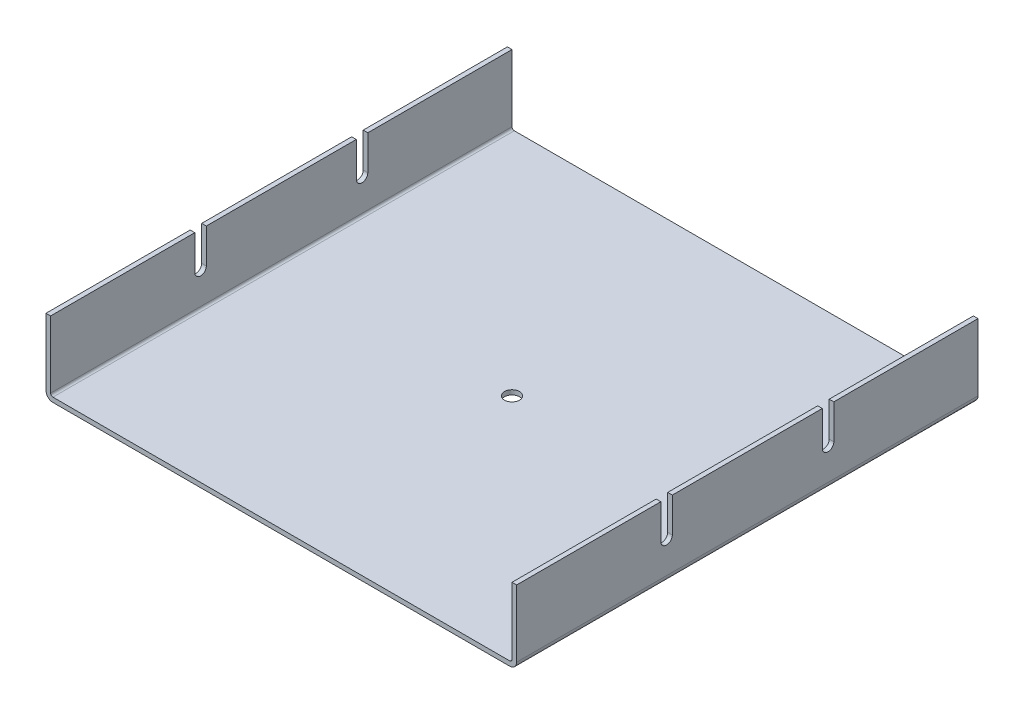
ISO-10303-21;
HEADER;
FILE_DESCRIPTION(('STEP AP214'),'2;1');
FILE_NAME('part.step','',(''),(''),'','','');
FILE_SCHEMA(('AUTOMOTIVE_DESIGN { 1 0 10303 214 1 1 1 1 }'));
ENDSEC;
DATA;
#1=APPLICATION_CONTEXT('core data for automotive mechanical design processes');
#2=APPLICATION_PROTOCOL_DEFINITION('international standard','automotive_design',2000,#1);
#3=PRODUCT_CONTEXT('',#1,'mechanical');
#4=PRODUCT('Part','Part','',(#3));
#5=PRODUCT_RELATED_PRODUCT_CATEGORY('part','',(#4));
#6=PRODUCT_DEFINITION_FORMATION('','',#4);
#7=PRODUCT_DEFINITION_CONTEXT('part definition',#1,'design');
#8=PRODUCT_DEFINITION('design','',#6,#7);
#9=PRODUCT_DEFINITION_SHAPE('','',#8);
#10=(LENGTH_UNIT() NAMED_UNIT(*) SI_UNIT(.MILLI.,.METRE.));
#11=(NAMED_UNIT(*) PLANE_ANGLE_UNIT() SI_UNIT($,.RADIAN.));
#12=(NAMED_UNIT(*) SI_UNIT($,.STERADIAN.) SOLID_ANGLE_UNIT());
#13=UNCERTAINTY_MEASURE_WITH_UNIT(LENGTH_MEASURE(1.E-05),#10,'distance_accuracy_value','');
#14=(GEOMETRIC_REPRESENTATION_CONTEXT(3) GLOBAL_UNCERTAINTY_ASSIGNED_CONTEXT((#13)) GLOBAL_UNIT_ASSIGNED_CONTEXT((#10,
#11,#12)) REPRESENTATION_CONTEXT('',''));
#15=CARTESIAN_POINT('',(0.,0.,0.));
#16=DIRECTION('',(0.,0.,1.));
#17=DIRECTION('',(1.,0.,0.));
#18=AXIS2_PLACEMENT_3D('',#15,#16,#17);
#19=CARTESIAN_POINT('',(100.,30.,100.));
#20=DIRECTION('',(0.,-1.,0.));
#21=DIRECTION('',(0.,0.,-1.));
#22=AXIS2_PLACEMENT_3D('',#19,#20,#21);
#23=PLANE('',#22);
#24=DIRECTION('',(0.,0.,-1.));
#25=VECTOR('',#24,1.);
#26=CARTESIAN_POINT('',(100.,30.,100.));
#27=LINE('',#26,#25);
#28=CARTESIAN_POINT('',(100.,30.,32.5));
#29=VERTEX_POINT('',#28);
#30=CARTESIAN_POINT('',(100.,30.,-32.5));
#31=VERTEX_POINT('',#30);
#32=EDGE_CURVE('E42',#29,#31,#27,.T.);
#33=ORIENTED_EDGE('',*,*,#32,.F.);
#34=DIRECTION('',(-1.,0.,0.));
#35=VECTOR('',#34,1.);
#36=CARTESIAN_POINT('',(102.,30.,32.5));
#37=LINE('',#36,#35);
#38=CARTESIAN_POINT('',(102.,30.,32.5));
#39=VERTEX_POINT('',#38);
#40=EDGE_CURVE('E256',#39,#29,#37,.T.);
#41=ORIENTED_EDGE('',*,*,#40,.F.);
#42=DIRECTION('',(0.,0.,-1.));
#43=VECTOR('',#42,1.);
#44=CARTESIAN_POINT('',(102.,30.,100.));
#45=LINE('',#44,#43);
#46=CARTESIAN_POINT('',(102.,30.,-32.5));
#47=VERTEX_POINT('',#46);
#48=EDGE_CURVE('E387',#39,#47,#45,.T.);
#49=ORIENTED_EDGE('',*,*,#48,.T.);
#50=DIRECTION('',(-1.,0.,0.));
#51=VECTOR('',#50,1.);
#52=CARTESIAN_POINT('',(102.,30.,-32.5));
#53=LINE('',#52,#51);
#54=EDGE_CURVE('E296',#47,#31,#53,.T.);
#55=ORIENTED_EDGE('',*,*,#54,.T.);
#56=EDGE_LOOP('',(#33,#41,#49,#55));
#57=FACE_BOUND('',#56,.T.);
#58=ADVANCED_FACE('F34',(#57),#23,.F.);
#59=CARTESIAN_POINT('',(-102.,30.,100.));
#60=DIRECTION('',(0.,-1.,0.));
#61=DIRECTION('',(0.,0.,-1.));
#62=AXIS2_PLACEMENT_3D('',#59,#60,#61);
#63=PLANE('',#62);
#64=DIRECTION('',(0.,0.,-1.));
#65=VECTOR('',#64,1.);
#66=CARTESIAN_POINT('',(-102.,30.,100.));
#67=LINE('',#66,#65);
#68=CARTESIAN_POINT('',(-102.,30.,32.5));
#69=VERTEX_POINT('',#68);
#70=CARTESIAN_POINT('',(-102.,30.,-32.5));
#71=VERTEX_POINT('',#70);
#72=EDGE_CURVE('E404',#69,#71,#67,.T.);
#73=ORIENTED_EDGE('',*,*,#72,.F.);
#74=CARTESIAN_POINT('',(-100.,30.,32.5));
#75=VERTEX_POINT('',#74);
#76=EDGE_CURVE('E258',#75,#69,#37,.T.);
#77=ORIENTED_EDGE('',*,*,#76,.F.);
#78=DIRECTION('',(0.,0.,-1.));
#79=VECTOR('',#78,1.);
#80=CARTESIAN_POINT('',(-100.,30.,100.));
#81=LINE('',#80,#79);
#82=CARTESIAN_POINT('',(-100.,30.,-32.5));
#83=VERTEX_POINT('',#82);
#84=EDGE_CURVE('E409',#75,#83,#81,.T.);
#85=ORIENTED_EDGE('',*,*,#84,.T.);
#86=EDGE_CURVE('E299',#83,#71,#53,.T.);
#87=ORIENTED_EDGE('',*,*,#86,.T.);
#88=EDGE_LOOP('',(#73,#77,#85,#87));
#89=FACE_BOUND('',#88,.T.);
#90=ADVANCED_FACE('F465',(#89),#63,.F.);
#91=CARTESIAN_POINT('',(100.,30.,-37.5));
#92=VERTEX_POINT('',#91);
#93=CARTESIAN_POINT('',(100.,30.,-100.));
#94=VERTEX_POINT('',#93);
#95=EDGE_CURVE('E43',#92,#94,#27,.T.);
#96=ORIENTED_EDGE('',*,*,#95,.F.);
#97=DIRECTION('',(-1.,0.,0.));
#98=VECTOR('',#97,1.);
#99=CARTESIAN_POINT('',(102.,30.,-37.5));
#100=LINE('',#99,#98);
#101=CARTESIAN_POINT('',(102.,30.,-37.5));
#102=VERTEX_POINT('',#101);
#103=EDGE_CURVE('E292',#102,#92,#100,.T.);
#104=ORIENTED_EDGE('',*,*,#103,.F.);
#105=CARTESIAN_POINT('',(102.,30.,-100.));
#106=VERTEX_POINT('',#105);
#107=EDGE_CURVE('E357',#102,#106,#45,.T.);
#108=ORIENTED_EDGE('',*,*,#107,.T.);
#109=DIRECTION('',(-1.,0.,0.));
#110=VECTOR('',#109,1.);
#111=CARTESIAN_POINT('',(100.,30.,-100.));
#112=LINE('',#111,#110);
#113=EDGE_CURVE('E330',#106,#94,#112,.T.);
#114=ORIENTED_EDGE('',*,*,#113,.T.);
#115=EDGE_LOOP('',(#96,#104,#108,#114));
#116=FACE_BOUND('',#115,.T.);
#117=ADVANCED_FACE('F438',(#116),#23,.F.);
#118=CARTESIAN_POINT('',(-102.,30.,-37.5));
#119=VERTEX_POINT('',#118);
#120=CARTESIAN_POINT('',(-102.,30.,-100.));
#121=VERTEX_POINT('',#120);
#122=EDGE_CURVE('E399',#119,#121,#67,.T.);
#123=ORIENTED_EDGE('',*,*,#122,.F.);
#124=CARTESIAN_POINT('',(-100.,30.,-37.5));
#125=VERTEX_POINT('',#124);
#126=EDGE_CURVE('E295',#125,#119,#100,.T.);
#127=ORIENTED_EDGE('',*,*,#126,.F.);
#128=CARTESIAN_POINT('',(-100.,30.,-100.));
#129=VERTEX_POINT('',#128);
#130=EDGE_CURVE('E403',#125,#129,#81,.T.);
#131=ORIENTED_EDGE('',*,*,#130,.T.);
#132=DIRECTION('',(-1.,0.,0.));
#133=VECTOR('',#132,1.);
#134=CARTESIAN_POINT('',(-102.,30.,-100.));
#135=LINE('',#134,#133);
#136=EDGE_CURVE('E371',#129,#121,#135,.T.);
#137=ORIENTED_EDGE('',*,*,#136,.T.);
#138=EDGE_LOOP('',(#123,#127,#131,#137));
#139=FACE_BOUND('',#138,.T.);
#140=ADVANCED_FACE('F457',(#139),#63,.F.);
#141=CARTESIAN_POINT('',(102.,30.,100.));
#142=VERTEX_POINT('',#141);
#143=CARTESIAN_POINT('',(102.,30.,37.5));
#144=VERTEX_POINT('',#143);
#145=EDGE_CURVE('E384',#142,#144,#45,.T.);
#146=ORIENTED_EDGE('',*,*,#145,.T.);
#147=DIRECTION('',(-1.,0.,0.));
#148=VECTOR('',#147,1.);
#149=CARTESIAN_POINT('',(102.,30.,37.5));
#150=LINE('',#149,#148);
#151=CARTESIAN_POINT('',(100.,30.,37.5));
#152=VERTEX_POINT('',#151);
#153=EDGE_CURVE('E58',#144,#152,#150,.T.);
#154=ORIENTED_EDGE('',*,*,#153,.T.);
#155=CARTESIAN_POINT('',(100.,30.,100.));
#156=VERTEX_POINT('',#155);
#157=EDGE_CURVE('E11',#156,#152,#27,.T.);
#158=ORIENTED_EDGE('',*,*,#157,.F.);
#159=DIRECTION('',(-1.,0.,0.));
#160=VECTOR('',#159,1.);
#161=CARTESIAN_POINT('',(100.,30.,100.));
#162=LINE('',#161,#160);
#163=EDGE_CURVE('E331',#142,#156,#162,.T.);
#164=ORIENTED_EDGE('',*,*,#163,.F.);
#165=EDGE_LOOP('',(#146,#154,#158,#164));
#166=FACE_BOUND('',#165,.T.);
#167=ADVANCED_FACE('F36',(#166),#23,.F.);
#168=CARTESIAN_POINT('',(100.,1.00000000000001,100.));
#169=DIRECTION('',(1.,0.,0.));
#170=DIRECTION('',(0.,0.,-1.));
#171=AXIS2_PLACEMENT_3D('',#168,#169,#170);
#172=PLANE('',#171);
#173=CARTESIAN_POINT('',(100.,15.,35.));
#174=DIRECTION('',(1.,0.,0.));
#175=DIRECTION('',(0.,0.,-1.));
#176=AXIS2_PLACEMENT_3D('',#173,#174,#175);
#177=CIRCLE('',#176,2.5);
#178=CARTESIAN_POINT('',(100.,15.,37.5));
#179=VERTEX_POINT('',#178);
#180=CARTESIAN_POINT('',(100.,15.,32.5));
#181=VERTEX_POINT('',#180);
#182=EDGE_CURVE('E229',#179,#181,#177,.T.);
#183=ORIENTED_EDGE('',*,*,#182,.T.);
#184=DIRECTION('',(0.,1.,0.));
#185=VECTOR('',#184,1.);
#186=CARTESIAN_POINT('',(100.,1.00000000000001,32.5));
#187=LINE('',#186,#185);
#188=EDGE_CURVE('E267',#181,#29,#187,.T.);
#189=ORIENTED_EDGE('',*,*,#188,.T.);
#190=ORIENTED_EDGE('',*,*,#32,.T.);
#191=DIRECTION('',(0.,-1.,0.));
#192=VECTOR('',#191,1.);
#193=CARTESIAN_POINT('',(100.,1.00000000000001,-32.5));
#194=LINE('',#193,#192);
#195=CARTESIAN_POINT('',(100.,15.,-32.5));
#196=VERTEX_POINT('',#195);
#197=EDGE_CURVE('E315',#31,#196,#194,.T.);
#198=ORIENTED_EDGE('',*,*,#197,.T.);
#199=CARTESIAN_POINT('',(100.,15.,-35.));
#200=DIRECTION('',(1.,0.,0.));
#201=DIRECTION('',(0.,0.,-1.));
#202=AXIS2_PLACEMENT_3D('',#199,#200,#201);
#203=CIRCLE('',#202,2.5);
#204=CARTESIAN_POINT('',(100.,15.,-37.5));
#205=VERTEX_POINT('',#204);
#206=EDGE_CURVE('E309',#196,#205,#203,.T.);
#207=ORIENTED_EDGE('',*,*,#206,.T.);
#208=DIRECTION('',(0.,1.,0.));
#209=VECTOR('',#208,1.);
#210=CARTESIAN_POINT('',(100.,1.00000000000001,-37.5));
#211=LINE('',#210,#209);
#212=EDGE_CURVE('E321',#205,#92,#211,.T.);
#213=ORIENTED_EDGE('',*,*,#212,.T.);
#214=ORIENTED_EDGE('',*,*,#95,.T.);
#215=DIRECTION('',(0.,-1.,0.));
#216=VECTOR('',#215,1.);
#217=CARTESIAN_POINT('',(100.,1.00000000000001,-100.));
#218=LINE('',#217,#216);
#219=CARTESIAN_POINT('',(100.,1.00000000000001,-100.));
#220=VERTEX_POINT('',#219);
#221=EDGE_CURVE('E360',#94,#220,#218,.T.);
#222=ORIENTED_EDGE('',*,*,#221,.T.);
#223=DIRECTION('',(0.,0.,-1.));
#224=VECTOR('',#223,1.);
#225=CARTESIAN_POINT('',(100.,1.00000000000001,100.));
#226=LINE('',#225,#224);
#227=CARTESIAN_POINT('',(100.,1.00000000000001,100.));
#228=VERTEX_POINT('',#227);
#229=EDGE_CURVE('E417',#228,#220,#226,.T.);
#230=ORIENTED_EDGE('',*,*,#229,.F.);
#231=DIRECTION('',(0.,-1.,0.));
#232=VECTOR('',#231,1.);
#233=CARTESIAN_POINT('',(100.,1.00000000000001,100.));
#234=LINE('',#233,#232);
#235=EDGE_CURVE('E334',#156,#228,#234,.T.);
#236=ORIENTED_EDGE('',*,*,#235,.F.);
#237=ORIENTED_EDGE('',*,*,#157,.T.);
#238=DIRECTION('',(0.,-1.,0.));
#239=VECTOR('',#238,1.);
#240=CARTESIAN_POINT('',(100.,1.00000000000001,37.5));
#241=LINE('',#240,#239);
#242=EDGE_CURVE('E262',#152,#179,#241,.T.);
#243=ORIENTED_EDGE('',*,*,#242,.T.);
#244=EDGE_LOOP('',(#183,#189,#190,#198,#207,#213,#214,#222,#230,#236,#237,#243));
#245=FACE_BOUND('',#244,.T.);
#246=ADVANCED_FACE('F428',(#245),#172,.F.);
#247=CARTESIAN_POINT('',(99.,1.,100.));
#248=DIRECTION('',(0.,0.,-1.));
#249=DIRECTION('',(-1.,0.,0.));
#250=AXIS2_PLACEMENT_3D('',#247,#248,#249);
#251=CYLINDRICAL_SURFACE('',#250,1.);
#252=CARTESIAN_POINT('',(99.,1.,-100.));
#253=DIRECTION('',(0.,0.,-1.));
#254=DIRECTION('',(1.,0.,0.));
#255=AXIS2_PLACEMENT_3D('',#252,#253,#254);
#256=CIRCLE('',#255,1.);
#257=CARTESIAN_POINT('',(99.,0.,-100.));
#258=VERTEX_POINT('',#257);
#259=EDGE_CURVE('E362',#220,#258,#256,.T.);
#260=ORIENTED_EDGE('',*,*,#259,.T.);
#261=DIRECTION('',(0.,0.,-1.));
#262=VECTOR('',#261,1.);
#263=CARTESIAN_POINT('',(99.,0.,100.));
#264=LINE('',#263,#262);
#265=CARTESIAN_POINT('',(99.,0.,100.));
#266=VERTEX_POINT('',#265);
#267=EDGE_CURVE('E415',#266,#258,#264,.T.);
#268=ORIENTED_EDGE('',*,*,#267,.F.);
#269=CARTESIAN_POINT('',(99.,1.,100.));
#270=DIRECTION('',(0.,0.,-1.));
#271=DIRECTION('',(1.,0.,0.));
#272=AXIS2_PLACEMENT_3D('',#269,#270,#271);
#273=CIRCLE('',#272,1.);
#274=EDGE_CURVE('E337',#228,#266,#273,.T.);
#275=ORIENTED_EDGE('',*,*,#274,.F.);
#276=ORIENTED_EDGE('',*,*,#229,.T.);
#277=EDGE_LOOP('',(#260,#268,#275,#276));
#278=FACE_BOUND('',#277,.T.);
#279=ADVANCED_FACE('F448',(#278),#251,.F.);
#280=CARTESIAN_POINT('',(-99.,0.,100.));
#281=DIRECTION('',(0.,-1.,0.));
#282=DIRECTION('',(0.,0.,-1.));
#283=AXIS2_PLACEMENT_3D('',#280,#281,#282);
#284=PLANE('',#283);
#285=CARTESIAN_POINT('',(0.,0.,0.));
#286=DIRECTION('',(0.,-1.,0.));
#287=DIRECTION('',(0.,0.,-1.));
#288=AXIS2_PLACEMENT_3D('',#285,#286,#287);
#289=CIRCLE('',#288,3.25);
#290=CARTESIAN_POINT('',(0.,0.,-3.25));
#291=VERTEX_POINT('',#290);
#292=EDGE_CURVE('E327',#291,#291,#289,.T.);
#293=ORIENTED_EDGE('',*,*,#292,.T.);
#294=EDGE_LOOP('',(#293));
#295=FACE_BOUND('',#294,.T.);
#296=DIRECTION('',(-1.,0.,0.));
#297=VECTOR('',#296,1.);
#298=CARTESIAN_POINT('',(-99.,0.,-100.));
#299=LINE('',#298,#297);
#300=CARTESIAN_POINT('',(-99.,0.,-100.));
#301=VERTEX_POINT('',#300);
#302=EDGE_CURVE('E364',#258,#301,#299,.T.);
#303=ORIENTED_EDGE('',*,*,#302,.T.);
#304=DIRECTION('',(0.,0.,-1.));
#305=VECTOR('',#304,1.);
#306=CARTESIAN_POINT('',(-99.,0.,100.));
#307=LINE('',#306,#305);
#308=CARTESIAN_POINT('',(-99.,0.,100.));
#309=VERTEX_POINT('',#308);
#310=EDGE_CURVE('E412',#309,#301,#307,.T.);
#311=ORIENTED_EDGE('',*,*,#310,.F.);
#312=DIRECTION('',(-1.,0.,0.));
#313=VECTOR('',#312,1.);
#314=CARTESIAN_POINT('',(-99.,0.,100.));
#315=LINE('',#314,#313);
#316=EDGE_CURVE('E339',#266,#309,#315,.T.);
#317=ORIENTED_EDGE('',*,*,#316,.F.);
#318=ORIENTED_EDGE('',*,*,#267,.T.);
#319=EDGE_LOOP('',(#303,#311,#317,#318));
#320=FACE_BOUND('',#319,.T.);
#321=ADVANCED_FACE('F734',(#295,#320),#284,.F.);
#322=CARTESIAN_POINT('',(-99.,1.,100.));
#323=DIRECTION('',(0.,0.,-1.));
#324=DIRECTION('',(-1.,0.,0.));
#325=AXIS2_PLACEMENT_3D('',#322,#323,#324);
#326=CYLINDRICAL_SURFACE('',#325,1.);
#327=CARTESIAN_POINT('',(-99.,1.,-100.));
#328=DIRECTION('',(0.,0.,-1.));
#329=DIRECTION('',(-1.,0.,0.));
#330=AXIS2_PLACEMENT_3D('',#327,#328,#329);
#331=CIRCLE('',#330,1.);
#332=CARTESIAN_POINT('',(-100.,1.00000000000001,-100.));
#333=VERTEX_POINT('',#332);
#334=EDGE_CURVE('E366',#301,#333,#331,.T.);
#335=ORIENTED_EDGE('',*,*,#334,.T.);
#336=DIRECTION('',(0.,0.,-1.));
#337=VECTOR('',#336,1.);
#338=CARTESIAN_POINT('',(-100.,1.00000000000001,100.));
#339=LINE('',#338,#337);
#340=CARTESIAN_POINT('',(-100.,1.00000000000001,100.));
#341=VERTEX_POINT('',#340);
#342=EDGE_CURVE('E408',#341,#333,#339,.T.);
#343=ORIENTED_EDGE('',*,*,#342,.F.);
#344=CARTESIAN_POINT('',(-99.,1.,100.));
#345=DIRECTION('',(0.,0.,-1.));
#346=DIRECTION('',(-1.,0.,0.));
#347=AXIS2_PLACEMENT_3D('',#344,#345,#346);
#348=CIRCLE('',#347,1.);
#349=EDGE_CURVE('E341',#309,#341,#348,.T.);
#350=ORIENTED_EDGE('',*,*,#349,.F.);
#351=ORIENTED_EDGE('',*,*,#310,.T.);
#352=EDGE_LOOP('',(#335,#343,#350,#351));
#353=FACE_BOUND('',#352,.T.);
#354=ADVANCED_FACE('F487',(#353),#326,.F.);
#355=CARTESIAN_POINT('',(-100.,1.00000000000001,100.));
#356=DIRECTION('',(-1.,0.,0.));
#357=DIRECTION('',(0.,0.,1.));
#358=AXIS2_PLACEMENT_3D('',#355,#356,#357);
#359=PLANE('',#358);
#360=ORIENTED_EDGE('',*,*,#84,.F.);
#361=DIRECTION('',(0.,-1.,0.));
#362=VECTOR('',#361,1.);
#363=CARTESIAN_POINT('',(-100.,1.00000000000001,32.5));
#364=LINE('',#363,#362);
#365=CARTESIAN_POINT('',(-100.,15.,32.5));
#366=VERTEX_POINT('',#365);
#367=EDGE_CURVE('E264',#75,#366,#364,.T.);
#368=ORIENTED_EDGE('',*,*,#367,.T.);
#369=CARTESIAN_POINT('',(-100.,15.,35.));
#370=DIRECTION('',(-1.,0.,0.));
#371=DIRECTION('',(0.,0.,1.));
#372=AXIS2_PLACEMENT_3D('',#369,#370,#371);
#373=CIRCLE('',#372,2.5);
#374=CARTESIAN_POINT('',(-100.,15.,37.5));
#375=VERTEX_POINT('',#374);
#376=EDGE_CURVE('E270',#366,#375,#373,.T.);
#377=ORIENTED_EDGE('',*,*,#376,.T.);
#378=DIRECTION('',(0.,1.,0.));
#379=VECTOR('',#378,1.);
#380=CARTESIAN_POINT('',(-100.,1.00000000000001,37.5));
#381=LINE('',#380,#379);
#382=CARTESIAN_POINT('',(-100.,30.,37.5));
#383=VERTEX_POINT('',#382);
#384=EDGE_CURVE('E254',#375,#383,#381,.T.);
#385=ORIENTED_EDGE('',*,*,#384,.T.);
#386=CARTESIAN_POINT('',(-100.,30.,100.));
#387=VERTEX_POINT('',#386);
#388=EDGE_CURVE('E405',#387,#383,#81,.T.);
#389=ORIENTED_EDGE('',*,*,#388,.F.);
#390=DIRECTION('',(0.,1.,0.));
#391=VECTOR('',#390,1.);
#392=CARTESIAN_POINT('',(-100.,1.00000000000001,100.));
#393=LINE('',#392,#391);
#394=EDGE_CURVE('E343',#341,#387,#393,.T.);
#395=ORIENTED_EDGE('',*,*,#394,.F.);
#396=ORIENTED_EDGE('',*,*,#342,.T.);
#397=DIRECTION('',(0.,1.,0.));
#398=VECTOR('',#397,1.);
#399=CARTESIAN_POINT('',(-100.,1.00000000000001,-100.));
#400=LINE('',#399,#398);
#401=EDGE_CURVE('E368',#333,#129,#400,.T.);
#402=ORIENTED_EDGE('',*,*,#401,.T.);
#403=ORIENTED_EDGE('',*,*,#130,.F.);
#404=DIRECTION('',(0.,-1.,0.));
#405=VECTOR('',#404,1.);
#406=CARTESIAN_POINT('',(-100.,1.00000000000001,-37.5));
#407=LINE('',#406,#405);
#408=CARTESIAN_POINT('',(-100.,15.,-37.5));
#409=VERTEX_POINT('',#408);
#410=EDGE_CURVE('E318',#125,#409,#407,.T.);
#411=ORIENTED_EDGE('',*,*,#410,.T.);
#412=CARTESIAN_POINT('',(-100.,15.,-35.));
#413=DIRECTION('',(-1.,0.,0.));
#414=DIRECTION('',(0.,0.,1.));
#415=AXIS2_PLACEMENT_3D('',#412,#413,#414);
#416=CIRCLE('',#415,2.5);
#417=CARTESIAN_POINT('',(-100.,15.,-32.5));
#418=VERTEX_POINT('',#417);
#419=EDGE_CURVE('E294',#409,#418,#416,.T.);
#420=ORIENTED_EDGE('',*,*,#419,.T.);
#421=DIRECTION('',(0.,1.,0.));
#422=VECTOR('',#421,1.);
#423=CARTESIAN_POINT('',(-100.,1.00000000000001,-32.5));
#424=LINE('',#423,#422);
#425=EDGE_CURVE('E312',#418,#83,#424,.T.);
#426=ORIENTED_EDGE('',*,*,#425,.T.);
#427=EDGE_LOOP('',(#360,#368,#377,#385,#389,#395,#396,#402,#403,#411,#420,#426));
#428=FACE_BOUND('',#427,.T.);
#429=ADVANCED_FACE('F479',(#428),#359,.F.);
#430=ORIENTED_EDGE('',*,*,#388,.T.);
#431=CARTESIAN_POINT('',(-102.,30.,37.5));
#432=VERTEX_POINT('',#431);
#433=EDGE_CURVE('E231',#383,#432,#150,.T.);
#434=ORIENTED_EDGE('',*,*,#433,.T.);
#435=CARTESIAN_POINT('',(-102.,30.,100.));
#436=VERTEX_POINT('',#435);
#437=EDGE_CURVE('E400',#436,#432,#67,.T.);
#438=ORIENTED_EDGE('',*,*,#437,.F.);
#439=DIRECTION('',(-1.,0.,0.));
#440=VECTOR('',#439,1.);
#441=CARTESIAN_POINT('',(-102.,30.,100.));
#442=LINE('',#441,#440);
#443=EDGE_CURVE('E345',#387,#436,#442,.T.);
#444=ORIENTED_EDGE('',*,*,#443,.F.);
#445=EDGE_LOOP('',(#430,#434,#438,#444));
#446=FACE_BOUND('',#445,.T.);
#447=ADVANCED_FACE('F464',(#446),#63,.F.);
#448=CARTESIAN_POINT('',(-102.,1.00000000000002,100.));
#449=DIRECTION('',(1.,0.,0.));
#450=DIRECTION('',(0.,0.,-1.));
#451=AXIS2_PLACEMENT_3D('',#448,#449,#450);
#452=PLANE('',#451);
#453=CARTESIAN_POINT('',(-102.,15.,35.));
#454=DIRECTION('',(-1.,0.,0.));
#455=DIRECTION('',(0.,0.,-1.));
#456=AXIS2_PLACEMENT_3D('',#453,#454,#455);
#457=CIRCLE('',#456,2.5);
#458=CARTESIAN_POINT('',(-102.,15.,32.5));
#459=VERTEX_POINT('',#458);
#460=CARTESIAN_POINT('',(-102.,15.,37.5));
#461=VERTEX_POINT('',#460);
#462=EDGE_CURVE('E50',#459,#461,#457,.T.);
#463=ORIENTED_EDGE('',*,*,#462,.F.);
#464=DIRECTION('',(0.,-1.,0.));
#465=VECTOR('',#464,1.);
#466=CARTESIAN_POINT('',(-102.,30.,32.5));
#467=LINE('',#466,#465);
#468=EDGE_CURVE('E243',#69,#459,#467,.T.);
#469=ORIENTED_EDGE('',*,*,#468,.F.);
#470=ORIENTED_EDGE('',*,*,#72,.T.);
#471=DIRECTION('',(0.,1.,0.));
#472=VECTOR('',#471,1.);
#473=CARTESIAN_POINT('',(-102.,30.,-32.5));
#474=LINE('',#473,#472);
#475=CARTESIAN_POINT('',(-102.,15.,-32.5));
#476=VERTEX_POINT('',#475);
#477=EDGE_CURVE('E279',#476,#71,#474,.T.);
#478=ORIENTED_EDGE('',*,*,#477,.F.);
#479=CARTESIAN_POINT('',(-102.,15.,-35.));
#480=DIRECTION('',(-1.,0.,0.));
#481=DIRECTION('',(0.,0.,1.));
#482=AXIS2_PLACEMENT_3D('',#479,#480,#481);
#483=CIRCLE('',#482,2.5);
#484=CARTESIAN_POINT('',(-102.,15.,-37.5));
#485=VERTEX_POINT('',#484);
#486=EDGE_CURVE('E287',#485,#476,#483,.T.);
#487=ORIENTED_EDGE('',*,*,#486,.F.);
#488=DIRECTION('',(0.,-1.,0.));
#489=VECTOR('',#488,1.);
#490=CARTESIAN_POINT('',(-102.,30.,-37.5));
#491=LINE('',#490,#489);
#492=EDGE_CURVE('E274',#119,#485,#491,.T.);
#493=ORIENTED_EDGE('',*,*,#492,.F.);
#494=ORIENTED_EDGE('',*,*,#122,.T.);
#495=DIRECTION('',(0.,-1.,0.));
#496=VECTOR('',#495,1.);
#497=CARTESIAN_POINT('',(-102.,1.00000000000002,-100.));
#498=LINE('',#497,#496);
#499=CARTESIAN_POINT('',(-102.,1.00000000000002,-100.));
#500=VERTEX_POINT('',#499);
#501=EDGE_CURVE('E374',#121,#500,#498,.T.);
#502=ORIENTED_EDGE('',*,*,#501,.T.);
#503=DIRECTION('',(0.,0.,-1.));
#504=VECTOR('',#503,1.);
#505=CARTESIAN_POINT('',(-102.,1.00000000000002,100.));
#506=LINE('',#505,#504);
#507=CARTESIAN_POINT('',(-102.,1.00000000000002,100.));
#508=VERTEX_POINT('',#507);
#509=EDGE_CURVE('E396',#508,#500,#506,.T.);
#510=ORIENTED_EDGE('',*,*,#509,.F.);
#511=DIRECTION('',(0.,-1.,0.));
#512=VECTOR('',#511,1.);
#513=CARTESIAN_POINT('',(-102.,1.00000000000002,100.));
#514=LINE('',#513,#512);
#515=EDGE_CURVE('E347',#436,#508,#514,.T.);
#516=ORIENTED_EDGE('',*,*,#515,.F.);
#517=ORIENTED_EDGE('',*,*,#437,.T.);
#518=DIRECTION('',(0.,1.,0.));
#519=VECTOR('',#518,1.);
#520=CARTESIAN_POINT('',(-102.,30.,37.5));
#521=LINE('',#520,#519);
#522=EDGE_CURVE('E246',#461,#432,#521,.T.);
#523=ORIENTED_EDGE('',*,*,#522,.F.);
#524=EDGE_LOOP('',(#463,#469,#470,#478,#487,#493,#494,#502,#510,#516,#517,#523));
#525=FACE_BOUND('',#524,.T.);
#526=ADVANCED_FACE('F478',(#525),#452,.F.);
#527=CARTESIAN_POINT('',(-99.,1.,100.));
#528=DIRECTION('',(0.,0.,-1.));
#529=DIRECTION('',(-1.,0.,0.));
#530=AXIS2_PLACEMENT_3D('',#527,#528,#529);
#531=CYLINDRICAL_SURFACE('',#530,3.);
#532=CARTESIAN_POINT('',(-99.,1.,-100.));
#533=DIRECTION('',(0.,0.,1.));
#534=DIRECTION('',(-1.,0.,0.));
#535=AXIS2_PLACEMENT_3D('',#532,#533,#534);
#536=CIRCLE('',#535,3.);
#537=CARTESIAN_POINT('',(-99.,-2.,-100.));
#538=VERTEX_POINT('',#537);
#539=EDGE_CURVE('E376',#500,#538,#536,.T.);
#540=ORIENTED_EDGE('',*,*,#539,.T.);
#541=DIRECTION('',(0.,0.,-1.));
#542=VECTOR('',#541,1.);
#543=CARTESIAN_POINT('',(-99.,-2.,100.));
#544=LINE('',#543,#542);
#545=CARTESIAN_POINT('',(-99.,-2.,100.));
#546=VERTEX_POINT('',#545);
#547=EDGE_CURVE('E393',#546,#538,#544,.T.);
#548=ORIENTED_EDGE('',*,*,#547,.F.);
#549=CARTESIAN_POINT('',(-99.,1.,100.));
#550=DIRECTION('',(0.,0.,1.));
#551=DIRECTION('',(-1.,0.,0.));
#552=AXIS2_PLACEMENT_3D('',#549,#550,#551);
#553=CIRCLE('',#552,3.);
#554=EDGE_CURVE('E349',#508,#546,#553,.T.);
#555=ORIENTED_EDGE('',*,*,#554,.F.);
#556=ORIENTED_EDGE('',*,*,#509,.T.);
#557=EDGE_LOOP('',(#540,#548,#555,#556));
#558=FACE_BOUND('',#557,.T.);
#559=ADVANCED_FACE('F485',(#558),#531,.T.);
#560=CARTESIAN_POINT('',(-99.,-2.,100.));
#561=DIRECTION('',(0.,1.,0.));
#562=DIRECTION('',(0.,0.,1.));
#563=AXIS2_PLACEMENT_3D('',#560,#561,#562);
#564=PLANE('',#563);
#565=CARTESIAN_POINT('',(0.,-2.,0.));
#566=DIRECTION('',(0.,-1.,0.));
#567=DIRECTION('',(0.,0.,-1.));
#568=AXIS2_PLACEMENT_3D('',#565,#566,#567);
#569=CIRCLE('',#568,3.25);
#570=CARTESIAN_POINT('',(0.,-2.,-3.25));
#571=VERTEX_POINT('',#570);
#572=EDGE_CURVE('E324',#571,#571,#569,.T.);
#573=ORIENTED_EDGE('',*,*,#572,.F.);
#574=EDGE_LOOP('',(#573));
#575=FACE_BOUND('',#574,.T.);
#576=DIRECTION('',(1.,0.,0.));
#577=VECTOR('',#576,1.);
#578=CARTESIAN_POINT('',(-99.,-2.,-100.));
#579=LINE('',#578,#577);
#580=CARTESIAN_POINT('',(99.,-2.,-100.));
#581=VERTEX_POINT('',#580);
#582=EDGE_CURVE('E378',#538,#581,#579,.T.);
#583=ORIENTED_EDGE('',*,*,#582,.T.);
#584=DIRECTION('',(0.,0.,-1.));
#585=VECTOR('',#584,1.);
#586=CARTESIAN_POINT('',(99.,-2.,100.));
#587=LINE('',#586,#585);
#588=CARTESIAN_POINT('',(99.,-2.,100.));
#589=VERTEX_POINT('',#588);
#590=EDGE_CURVE('E390',#589,#581,#587,.T.);
#591=ORIENTED_EDGE('',*,*,#590,.F.);
#592=DIRECTION('',(1.,0.,0.));
#593=VECTOR('',#592,1.);
#594=CARTESIAN_POINT('',(-99.,-2.,100.));
#595=LINE('',#594,#593);
#596=EDGE_CURVE('E351',#546,#589,#595,.T.);
#597=ORIENTED_EDGE('',*,*,#596,.F.);
#598=ORIENTED_EDGE('',*,*,#547,.T.);
#599=EDGE_LOOP('',(#583,#591,#597,#598));
#600=FACE_BOUND('',#599,.T.);
#601=ADVANCED_FACE('F560',(#575,#600),#564,.F.);
#602=CARTESIAN_POINT('',(99.,1.,100.));
#603=DIRECTION('',(0.,0.,-1.));
#604=DIRECTION('',(-1.,0.,0.));
#605=AXIS2_PLACEMENT_3D('',#602,#603,#604);
#606=CYLINDRICAL_SURFACE('',#605,3.);
#607=CARTESIAN_POINT('',(99.,1.,-100.));
#608=DIRECTION('',(0.,0.,1.));
#609=DIRECTION('',(-1.,0.,0.));
#610=AXIS2_PLACEMENT_3D('',#607,#608,#609);
#611=CIRCLE('',#610,3.);
#612=CARTESIAN_POINT('',(102.,1.00000000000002,-100.));
#613=VERTEX_POINT('',#612);
#614=EDGE_CURVE('E380',#581,#613,#611,.T.);
#615=ORIENTED_EDGE('',*,*,#614,.T.);
#616=DIRECTION('',(0.,0.,-1.));
#617=VECTOR('',#616,1.);
#618=CARTESIAN_POINT('',(102.,1.00000000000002,100.));
#619=LINE('',#618,#617);
#620=CARTESIAN_POINT('',(102.,1.00000000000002,100.));
#621=VERTEX_POINT('',#620);
#622=EDGE_CURVE('E386',#621,#613,#619,.T.);
#623=ORIENTED_EDGE('',*,*,#622,.F.);
#624=CARTESIAN_POINT('',(99.,1.,100.));
#625=DIRECTION('',(0.,0.,1.));
#626=DIRECTION('',(-1.,0.,0.));
#627=AXIS2_PLACEMENT_3D('',#624,#625,#626);
#628=CIRCLE('',#627,3.);
#629=EDGE_CURVE('E353',#589,#621,#628,.T.);
#630=ORIENTED_EDGE('',*,*,#629,.F.);
#631=ORIENTED_EDGE('',*,*,#590,.T.);
#632=EDGE_LOOP('',(#615,#623,#630,#631));
#633=FACE_BOUND('',#632,.T.);
#634=ADVANCED_FACE('F557',(#633),#606,.T.);
#635=CARTESIAN_POINT('',(102.,1.00000000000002,100.));
#636=DIRECTION('',(-1.,0.,0.));
#637=DIRECTION('',(0.,0.,1.));
#638=AXIS2_PLACEMENT_3D('',#635,#636,#637);
#639=PLANE('',#638);
#640=ORIENTED_EDGE('',*,*,#48,.F.);
#641=DIRECTION('',(0.,-1.,0.));
#642=VECTOR('',#641,1.);
#643=CARTESIAN_POINT('',(102.,30.,32.5));
#644=LINE('',#643,#642);
#645=CARTESIAN_POINT('',(102.,15.,32.5));
#646=VERTEX_POINT('',#645);
#647=EDGE_CURVE('E239',#39,#646,#644,.T.);
#648=ORIENTED_EDGE('',*,*,#647,.T.);
#649=CARTESIAN_POINT('',(102.,15.,35.));
#650=DIRECTION('',(-1.,0.,0.));
#651=DIRECTION('',(0.,0.,-1.));
#652=AXIS2_PLACEMENT_3D('',#649,#650,#651);
#653=CIRCLE('',#652,2.5);
#654=CARTESIAN_POINT('',(102.,15.,37.5));
#655=VERTEX_POINT('',#654);
#656=EDGE_CURVE('E226',#646,#655,#653,.T.);
#657=ORIENTED_EDGE('',*,*,#656,.T.);
#658=DIRECTION('',(0.,1.,0.));
#659=VECTOR('',#658,1.);
#660=CARTESIAN_POINT('',(102.,30.,37.5));
#661=LINE('',#660,#659);
#662=EDGE_CURVE('E234',#655,#144,#661,.T.);
#663=ORIENTED_EDGE('',*,*,#662,.T.);
#664=ORIENTED_EDGE('',*,*,#145,.F.);
#665=DIRECTION('',(0.,1.,0.));
#666=VECTOR('',#665,1.);
#667=CARTESIAN_POINT('',(102.,1.00000000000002,100.));
#668=LINE('',#667,#666);
#669=EDGE_CURVE('E355',#621,#142,#668,.T.);
#670=ORIENTED_EDGE('',*,*,#669,.F.);
#671=ORIENTED_EDGE('',*,*,#622,.T.);
#672=DIRECTION('',(0.,1.,0.));
#673=VECTOR('',#672,1.);
#674=CARTESIAN_POINT('',(102.,1.00000000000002,-100.));
#675=LINE('',#674,#673);
#676=EDGE_CURVE('E335',#613,#106,#675,.T.);
#677=ORIENTED_EDGE('',*,*,#676,.T.);
#678=ORIENTED_EDGE('',*,*,#107,.F.);
#679=DIRECTION('',(0.,-1.,0.));
#680=VECTOR('',#679,1.);
#681=CARTESIAN_POINT('',(102.,30.,-37.5));
#682=LINE('',#681,#680);
#683=CARTESIAN_POINT('',(102.,15.,-37.5));
#684=VERTEX_POINT('',#683);
#685=EDGE_CURVE('E275',#102,#684,#682,.T.);
#686=ORIENTED_EDGE('',*,*,#685,.T.);
#687=CARTESIAN_POINT('',(102.,15.,-35.));
#688=DIRECTION('',(-1.,0.,0.));
#689=DIRECTION('',(0.,0.,1.));
#690=AXIS2_PLACEMENT_3D('',#687,#688,#689);
#691=CIRCLE('',#690,2.5);
#692=CARTESIAN_POINT('',(102.,15.,-32.5));
#693=VERTEX_POINT('',#692);
#694=EDGE_CURVE('E278',#684,#693,#691,.T.);
#695=ORIENTED_EDGE('',*,*,#694,.T.);
#696=DIRECTION('',(0.,1.,0.));
#697=VECTOR('',#696,1.);
#698=CARTESIAN_POINT('',(102.,30.,-32.5));
#699=LINE('',#698,#697);
#700=EDGE_CURVE('E282',#693,#47,#699,.T.);
#701=ORIENTED_EDGE('',*,*,#700,.T.);
#702=EDGE_LOOP('',(#640,#648,#657,#663,#664,#670,#671,#677,#678,#686,#695,#701));
#703=FACE_BOUND('',#702,.T.);
#704=ADVANCED_FACE('F242',(#703),#639,.F.);
#705=CARTESIAN_POINT('',(99.,1.,100.));
#706=DIRECTION('',(0.,0.,-1.));
#707=DIRECTION('',(-1.,0.,0.));
#708=AXIS2_PLACEMENT_3D('',#705,#706,#707);
#709=PLANE('',#708);
#710=ORIENTED_EDGE('',*,*,#163,.T.);
#711=ORIENTED_EDGE('',*,*,#235,.T.);
#712=ORIENTED_EDGE('',*,*,#274,.T.);
#713=ORIENTED_EDGE('',*,*,#316,.T.);
#714=ORIENTED_EDGE('',*,*,#349,.T.);
#715=ORIENTED_EDGE('',*,*,#394,.T.);
#716=ORIENTED_EDGE('',*,*,#443,.T.);
#717=ORIENTED_EDGE('',*,*,#515,.T.);
#718=ORIENTED_EDGE('',*,*,#554,.T.);
#719=ORIENTED_EDGE('',*,*,#596,.T.);
#720=ORIENTED_EDGE('',*,*,#629,.T.);
#721=ORIENTED_EDGE('',*,*,#669,.T.);
#722=EDGE_LOOP('',(#710,#711,#712,#713,#714,#715,#716,#717,#718,#719,#720,#721));
#723=FACE_BOUND('',#722,.T.);
#724=ADVANCED_FACE('F451',(#723),#709,.F.);
#725=CARTESIAN_POINT('',(99.,1.,-100.));
#726=DIRECTION('',(0.,0.,-1.));
#727=DIRECTION('',(-1.,0.,0.));
#728=AXIS2_PLACEMENT_3D('',#725,#726,#727);
#729=PLANE('',#728);
#730=ORIENTED_EDGE('',*,*,#113,.F.);
#731=ORIENTED_EDGE('',*,*,#676,.F.);
#732=ORIENTED_EDGE('',*,*,#614,.F.);
#733=ORIENTED_EDGE('',*,*,#582,.F.);
#734=ORIENTED_EDGE('',*,*,#539,.F.);
#735=ORIENTED_EDGE('',*,*,#501,.F.);
#736=ORIENTED_EDGE('',*,*,#136,.F.);
#737=ORIENTED_EDGE('',*,*,#401,.F.);
#738=ORIENTED_EDGE('',*,*,#334,.F.);
#739=ORIENTED_EDGE('',*,*,#302,.F.);
#740=ORIENTED_EDGE('',*,*,#259,.F.);
#741=ORIENTED_EDGE('',*,*,#221,.F.);
#742=EDGE_LOOP('',(#730,#731,#732,#733,#734,#735,#736,#737,#738,#739,#740,#741));
#743=FACE_BOUND('',#742,.T.);
#744=ADVANCED_FACE('F445',(#743),#729,.T.);
#745=CARTESIAN_POINT('',(0.,30.,0.));
#746=DIRECTION('',(0.,-1.,0.));
#747=DIRECTION('',(0.,0.,-1.));
#748=AXIS2_PLACEMENT_3D('',#745,#746,#747);
#749=CYLINDRICAL_SURFACE('',#748,3.25);
#750=ORIENTED_EDGE('',*,*,#572,.T.);
#751=EDGE_LOOP('',(#750));
#752=FACE_BOUND('',#751,.T.);
#753=ORIENTED_EDGE('',*,*,#292,.F.);
#754=EDGE_LOOP('',(#753));
#755=FACE_BOUND('',#754,.T.);
#756=ADVANCED_FACE('F547',(#752,#755),#749,.F.);
#757=CARTESIAN_POINT('',(102.,15.,-35.));
#758=DIRECTION('',(-1.,0.,0.));
#759=DIRECTION('',(0.,0.,1.));
#760=AXIS2_PLACEMENT_3D('',#757,#758,#759);
#761=CYLINDRICAL_SURFACE('',#760,2.5);
#762=DIRECTION('',(-1.,0.,0.));
#763=VECTOR('',#762,1.);
#764=CARTESIAN_POINT('',(102.,15.,-32.5));
#765=LINE('',#764,#763);
#766=EDGE_CURVE('E300',#693,#196,#765,.T.);
#767=ORIENTED_EDGE('',*,*,#766,.F.);
#768=ORIENTED_EDGE('',*,*,#694,.F.);
#769=DIRECTION('',(-1.,0.,0.));
#770=VECTOR('',#769,1.);
#771=CARTESIAN_POINT('',(102.,15.,-37.5));
#772=LINE('',#771,#770);
#773=EDGE_CURVE('E304',#684,#205,#772,.T.);
#774=ORIENTED_EDGE('',*,*,#773,.T.);
#775=ORIENTED_EDGE('',*,*,#206,.F.);
#776=EDGE_LOOP('',(#767,#768,#774,#775));
#777=FACE_BOUND('',#776,.T.);
#778=ADVANCED_FACE('F546',(#777),#761,.F.);
#779=CARTESIAN_POINT('',(102.,30.,-32.5));
#780=DIRECTION('',(0.,0.,1.));
#781=DIRECTION('',(1.,0.,0.));
#782=AXIS2_PLACEMENT_3D('',#779,#780,#781);
#783=PLANE('',#782);
#784=ORIENTED_EDGE('',*,*,#54,.F.);
#785=ORIENTED_EDGE('',*,*,#700,.F.);
#786=ORIENTED_EDGE('',*,*,#766,.T.);
#787=ORIENTED_EDGE('',*,*,#197,.F.);
#788=EDGE_LOOP('',(#784,#785,#786,#787));
#789=FACE_BOUND('',#788,.T.);
#790=ADVANCED_FACE('F433',(#789),#783,.F.);
#791=CARTESIAN_POINT('',(102.,30.,-37.5));
#792=DIRECTION('',(0.,0.,-1.));
#793=DIRECTION('',(-1.,0.,0.));
#794=AXIS2_PLACEMENT_3D('',#791,#792,#793);
#795=PLANE('',#794);
#796=ORIENTED_EDGE('',*,*,#773,.F.);
#797=ORIENTED_EDGE('',*,*,#685,.F.);
#798=ORIENTED_EDGE('',*,*,#103,.T.);
#799=ORIENTED_EDGE('',*,*,#212,.F.);
#800=EDGE_LOOP('',(#796,#797,#798,#799));
#801=FACE_BOUND('',#800,.T.);
#802=ADVANCED_FACE('F536',(#801),#795,.F.);
#803=ORIENTED_EDGE('',*,*,#126,.T.);
#804=ORIENTED_EDGE('',*,*,#492,.T.);
#805=EDGE_CURVE('E285',#409,#485,#772,.T.);
#806=ORIENTED_EDGE('',*,*,#805,.F.);
#807=ORIENTED_EDGE('',*,*,#410,.F.);
#808=EDGE_LOOP('',(#803,#804,#806,#807));
#809=FACE_BOUND('',#808,.T.);
#810=ADVANCED_FACE('F534',(#809),#795,.F.);
#811=EDGE_CURVE('E303',#418,#476,#765,.T.);
#812=ORIENTED_EDGE('',*,*,#811,.T.);
#813=ORIENTED_EDGE('',*,*,#477,.T.);
#814=ORIENTED_EDGE('',*,*,#86,.F.);
#815=ORIENTED_EDGE('',*,*,#425,.F.);
#816=EDGE_LOOP('',(#812,#813,#814,#815));
#817=FACE_BOUND('',#816,.T.);
#818=ADVANCED_FACE('F526',(#817),#783,.F.);
#819=ORIENTED_EDGE('',*,*,#805,.T.);
#820=ORIENTED_EDGE('',*,*,#486,.T.);
#821=ORIENTED_EDGE('',*,*,#811,.F.);
#822=ORIENTED_EDGE('',*,*,#419,.F.);
#823=EDGE_LOOP('',(#819,#820,#821,#822));
#824=FACE_BOUND('',#823,.T.);
#825=ADVANCED_FACE('F531',(#824),#761,.F.);
#826=CARTESIAN_POINT('',(102.,30.,32.5));
#827=DIRECTION('',(0.,0.,-1.));
#828=DIRECTION('',(-1.,0.,0.));
#829=AXIS2_PLACEMENT_3D('',#826,#827,#828);
#830=PLANE('',#829);
#831=DIRECTION('',(-1.,0.,0.));
#832=VECTOR('',#831,1.);
#833=CARTESIAN_POINT('',(102.,15.,32.5));
#834=LINE('',#833,#832);
#835=EDGE_CURVE('E252',#646,#181,#834,.T.);
#836=ORIENTED_EDGE('',*,*,#835,.F.);
#837=ORIENTED_EDGE('',*,*,#647,.F.);
#838=ORIENTED_EDGE('',*,*,#40,.T.);
#839=ORIENTED_EDGE('',*,*,#188,.F.);
#840=EDGE_LOOP('',(#836,#837,#838,#839));
#841=FACE_BOUND('',#840,.T.);
#842=ADVANCED_FACE('F631',(#841),#830,.F.);
#843=CARTESIAN_POINT('',(102.,30.,37.5));
#844=DIRECTION('',(0.,0.,1.));
#845=DIRECTION('',(1.,0.,0.));
#846=AXIS2_PLACEMENT_3D('',#843,#844,#845);
#847=PLANE('',#846);
#848=ORIENTED_EDGE('',*,*,#153,.F.);
#849=ORIENTED_EDGE('',*,*,#662,.F.);
#850=DIRECTION('',(-1.,0.,0.));
#851=VECTOR('',#850,1.);
#852=CARTESIAN_POINT('',(102.,15.,37.5));
#853=LINE('',#852,#851);
#854=EDGE_CURVE('E222',#655,#179,#853,.T.);
#855=ORIENTED_EDGE('',*,*,#854,.T.);
#856=ORIENTED_EDGE('',*,*,#242,.F.);
#857=EDGE_LOOP('',(#848,#849,#855,#856));
#858=FACE_BOUND('',#857,.T.);
#859=ADVANCED_FACE('F235',(#858),#847,.F.);
#860=CARTESIAN_POINT('',(102.,15.,35.));
#861=DIRECTION('',(-1.,0.,0.));
#862=DIRECTION('',(0.,0.,1.));
#863=AXIS2_PLACEMENT_3D('',#860,#861,#862);
#864=CYLINDRICAL_SURFACE('',#863,2.5);
#865=ORIENTED_EDGE('',*,*,#854,.F.);
#866=ORIENTED_EDGE('',*,*,#656,.F.);
#867=ORIENTED_EDGE('',*,*,#835,.T.);
#868=ORIENTED_EDGE('',*,*,#182,.F.);
#869=EDGE_LOOP('',(#865,#866,#867,#868));
#870=FACE_BOUND('',#869,.T.);
#871=ADVANCED_FACE('F223',(#870),#864,.F.);
#872=EDGE_CURVE('E255',#366,#459,#834,.T.);
#873=ORIENTED_EDGE('',*,*,#872,.T.);
#874=ORIENTED_EDGE('',*,*,#462,.T.);
#875=EDGE_CURVE('E232',#375,#461,#853,.T.);
#876=ORIENTED_EDGE('',*,*,#875,.F.);
#877=ORIENTED_EDGE('',*,*,#376,.F.);
#878=EDGE_LOOP('',(#873,#874,#876,#877));
#879=FACE_BOUND('',#878,.T.);
#880=ADVANCED_FACE('F498',(#879),#864,.F.);
#881=ORIENTED_EDGE('',*,*,#76,.T.);
#882=ORIENTED_EDGE('',*,*,#468,.T.);
#883=ORIENTED_EDGE('',*,*,#872,.F.);
#884=ORIENTED_EDGE('',*,*,#367,.F.);
#885=EDGE_LOOP('',(#881,#882,#883,#884));
#886=FACE_BOUND('',#885,.T.);
#887=ADVANCED_FACE('F501',(#886),#830,.F.);
#888=ORIENTED_EDGE('',*,*,#875,.T.);
#889=ORIENTED_EDGE('',*,*,#522,.T.);
#890=ORIENTED_EDGE('',*,*,#433,.F.);
#891=ORIENTED_EDGE('',*,*,#384,.F.);
#892=EDGE_LOOP('',(#888,#889,#890,#891));
#893=FACE_BOUND('',#892,.T.);
#894=ADVANCED_FACE('F496',(#893),#847,.F.);
#895=CLOSED_SHELL('',(#58,#90,#117,#140,#167,#246,#279,#321,#354,#429,#447,#526,#559,#601,#634,
#704,#724,#744,#756,#778,#790,#802,#810,#818,#825,#842,#859,#871,#880,#887,#894));
#896=MANIFOLD_SOLID_BREP('B2',#895);
#897=ADVANCED_BREP_SHAPE_REPRESENTATION('',(#18,#896),#14);
#898=SHAPE_DEFINITION_REPRESENTATION(#9,#897);
ENDSEC;
END-ISO-10303-21;
